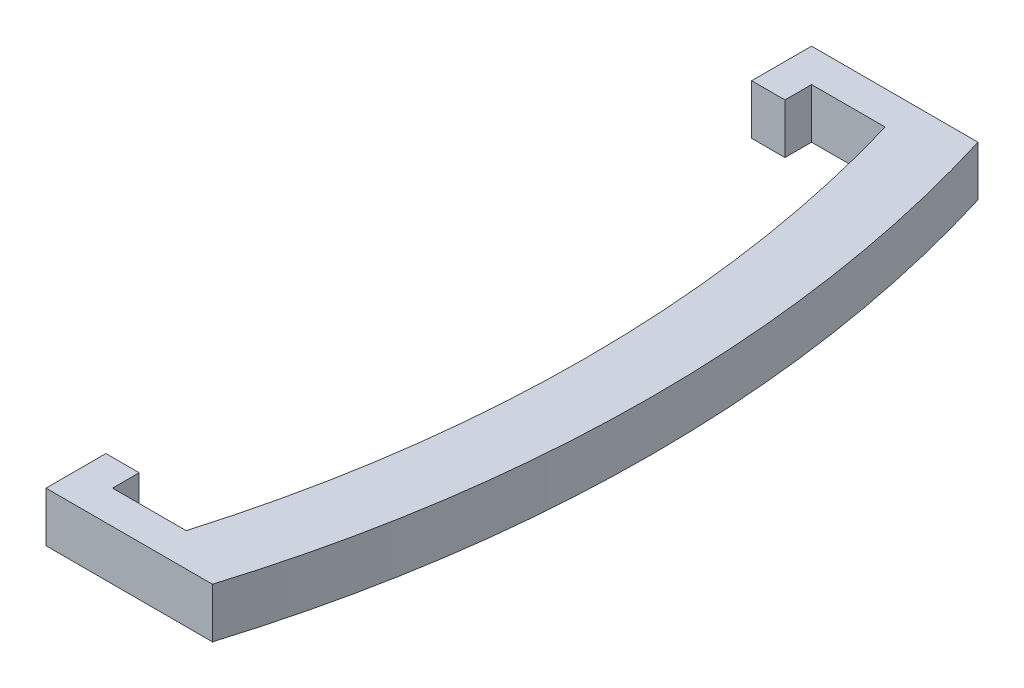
ISO-10303-21;
HEADER;
FILE_DESCRIPTION(('STEP AP214'),'2;1');
FILE_NAME('part.step','',(''),(''),'','','');
FILE_SCHEMA(('AUTOMOTIVE_DESIGN { 1 0 10303 214 1 1 1 1 }'));
ENDSEC;
DATA;
#1=APPLICATION_CONTEXT('core data for automotive mechanical design processes');
#2=APPLICATION_PROTOCOL_DEFINITION('international standard','automotive_design',2000,#1);
#3=PRODUCT_CONTEXT('',#1,'mechanical');
#4=PRODUCT('Part','Part','',(#3));
#5=PRODUCT_RELATED_PRODUCT_CATEGORY('part','',(#4));
#6=PRODUCT_DEFINITION_FORMATION('','',#4);
#7=PRODUCT_DEFINITION_CONTEXT('part definition',#1,'design');
#8=PRODUCT_DEFINITION('design','',#6,#7);
#9=PRODUCT_DEFINITION_SHAPE('','',#8);
#10=(LENGTH_UNIT() NAMED_UNIT(*) SI_UNIT(.MILLI.,.METRE.));
#11=(NAMED_UNIT(*) PLANE_ANGLE_UNIT() SI_UNIT($,.RADIAN.));
#12=(NAMED_UNIT(*) SI_UNIT($,.STERADIAN.) SOLID_ANGLE_UNIT());
#13=UNCERTAINTY_MEASURE_WITH_UNIT(LENGTH_MEASURE(1.E-05),#10,'distance_accuracy_value','');
#14=(GEOMETRIC_REPRESENTATION_CONTEXT(3) GLOBAL_UNCERTAINTY_ASSIGNED_CONTEXT((#13)) GLOBAL_UNIT_ASSIGNED_CONTEXT((#10,
#11,#12)) REPRESENTATION_CONTEXT('',''));
#15=CARTESIAN_POINT('',(0.,0.,0.));
#16=DIRECTION('',(0.,0.,1.));
#17=DIRECTION('',(1.,0.,0.));
#18=AXIS2_PLACEMENT_3D('',#15,#16,#17);
#19=CARTESIAN_POINT('',(47.51,-1.5,-20.4));
#20=DIRECTION('',(0.,1.,0.));
#21=DIRECTION('',(0.,0.,1.));
#22=AXIS2_PLACEMENT_3D('',#19,#20,#21);
#23=CYLINDRICAL_SURFACE('',#22,37.21);
#24=CARTESIAN_POINT('',(47.51,0.,-20.4));
#25=DIRECTION('',(0.,-1.,0.));
#26=DIRECTION('',(0.,0.,1.));
#27=AXIS2_PLACEMENT_3D('',#24,#25,#26);
#28=CIRCLE('',#27,37.21);
#29=CARTESIAN_POINT('',(83.207816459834,0.,-30.9));
#30=VERTEX_POINT('',#29);
#31=CARTESIAN_POINT('',(83.207816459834,0.,-9.9));
#32=VERTEX_POINT('',#31);
#33=EDGE_CURVE('E119',#30,#32,#28,.T.);
#34=ORIENTED_EDGE('',*,*,#33,.F.);
#35=DIRECTION('',(0.,1.,0.));
#36=VECTOR('',#35,1.);
#37=CARTESIAN_POINT('',(83.207816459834,-1.5,-30.9));
#38=LINE('',#37,#36);
#39=CARTESIAN_POINT('',(83.207816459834,-1.5,-30.9));
#40=VERTEX_POINT('',#39);
#41=EDGE_CURVE('E11',#40,#30,#38,.T.);
#42=ORIENTED_EDGE('',*,*,#41,.F.);
#43=CARTESIAN_POINT('',(47.51,-1.5,-20.4));
#44=DIRECTION('',(0.,-1.,0.));
#45=DIRECTION('',(0.,0.,1.));
#46=AXIS2_PLACEMENT_3D('',#43,#44,#45);
#47=CIRCLE('',#46,37.21);
#48=CARTESIAN_POINT('',(83.207816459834,-1.5,-9.9));
#49=VERTEX_POINT('',#48);
#50=EDGE_CURVE('E121',#40,#49,#47,.T.);
#51=ORIENTED_EDGE('',*,*,#50,.T.);
#52=DIRECTION('',(0.,1.,0.));
#53=VECTOR('',#52,1.);
#54=CARTESIAN_POINT('',(83.207816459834,-1.5,-9.9));
#55=LINE('',#54,#53);
#56=EDGE_CURVE('E34',#49,#32,#55,.T.);
#57=ORIENTED_EDGE('',*,*,#56,.T.);
#58=EDGE_LOOP('',(#34,#42,#51,#57));
#59=FACE_BOUND('',#58,.T.);
#60=ADVANCED_FACE('F31',(#59),#23,.F.);
#61=CARTESIAN_POINT('',(80.9956519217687,-1.5,-30.9));
#62=DIRECTION('',(0.,0.,1.));
#63=DIRECTION('',(1.,0.,0.));
#64=AXIS2_PLACEMENT_3D('',#61,#62,#63);
#65=PLANE('',#64);
#66=DIRECTION('',(1.,0.,0.));
#67=VECTOR('',#66,1.);
#68=CARTESIAN_POINT('',(80.9956519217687,0.,-30.9));
#69=LINE('',#68,#67);
#70=CARTESIAN_POINT('',(80.9956519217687,0.,-30.9));
#71=VERTEX_POINT('',#70);
#72=EDGE_CURVE('E137',#71,#30,#69,.T.);
#73=ORIENTED_EDGE('',*,*,#72,.F.);
#74=DIRECTION('',(0.,1.,0.));
#75=VECTOR('',#74,1.);
#76=CARTESIAN_POINT('',(80.9956519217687,-1.5,-30.9));
#77=LINE('',#76,#75);
#78=CARTESIAN_POINT('',(80.9956519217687,-1.5,-30.9));
#79=VERTEX_POINT('',#78);
#80=EDGE_CURVE('E39',#79,#71,#77,.T.);
#81=ORIENTED_EDGE('',*,*,#80,.F.);
#82=DIRECTION('',(1.,0.,0.));
#83=VECTOR('',#82,1.);
#84=CARTESIAN_POINT('',(80.9956519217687,-1.5,-30.9));
#85=LINE('',#84,#83);
#86=EDGE_CURVE('E126',#79,#40,#85,.T.);
#87=ORIENTED_EDGE('',*,*,#86,.T.);
#88=ORIENTED_EDGE('',*,*,#41,.T.);
#89=EDGE_LOOP('',(#73,#81,#87,#88));
#90=FACE_BOUND('',#89,.T.);
#91=ADVANCED_FACE('F244',(#90),#65,.T.);
#92=CARTESIAN_POINT('',(80.9956519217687,-1.5,-30.1));
#93=DIRECTION('',(1.,0.,0.));
#94=DIRECTION('',(0.,0.,-1.));
#95=AXIS2_PLACEMENT_3D('',#92,#93,#94);
#96=PLANE('',#95);
#97=DIRECTION('',(0.,0.,-1.));
#98=VECTOR('',#97,1.);
#99=CARTESIAN_POINT('',(80.9956519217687,0.,-30.1));
#100=LINE('',#99,#98);
#101=CARTESIAN_POINT('',(80.9956519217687,0.,-30.1));
#102=VERTEX_POINT('',#101);
#103=EDGE_CURVE('E162',#102,#71,#100,.T.);
#104=ORIENTED_EDGE('',*,*,#103,.F.);
#105=DIRECTION('',(0.,1.,0.));
#106=VECTOR('',#105,1.);
#107=CARTESIAN_POINT('',(80.9956519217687,-1.5,-30.1));
#108=LINE('',#107,#106);
#109=CARTESIAN_POINT('',(80.9956519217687,-1.5,-30.1));
#110=VERTEX_POINT('',#109);
#111=EDGE_CURVE('E196',#110,#102,#108,.T.);
#112=ORIENTED_EDGE('',*,*,#111,.F.);
#113=DIRECTION('',(0.,0.,-1.));
#114=VECTOR('',#113,1.);
#115=CARTESIAN_POINT('',(80.9956519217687,-1.5,-30.1));
#116=LINE('',#115,#114);
#117=EDGE_CURVE('E192',#110,#79,#116,.T.);
#118=ORIENTED_EDGE('',*,*,#117,.T.);
#119=ORIENTED_EDGE('',*,*,#80,.T.);
#120=EDGE_LOOP('',(#104,#112,#118,#119));
#121=FACE_BOUND('',#120,.T.);
#122=ADVANCED_FACE('F249',(#121),#96,.T.);
#123=CARTESIAN_POINT('',(79.9956519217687,-1.5,-30.1));
#124=DIRECTION('',(0.,0.,1.));
#125=DIRECTION('',(1.,0.,0.));
#126=AXIS2_PLACEMENT_3D('',#123,#124,#125);
#127=PLANE('',#126);
#128=DIRECTION('',(1.,0.,0.));
#129=VECTOR('',#128,1.);
#130=CARTESIAN_POINT('',(79.9956519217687,0.,-30.1));
#131=LINE('',#130,#129);
#132=CARTESIAN_POINT('',(79.9956519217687,0.,-30.1));
#133=VERTEX_POINT('',#132);
#134=EDGE_CURVE('E159',#133,#102,#131,.T.);
#135=ORIENTED_EDGE('',*,*,#134,.F.);
#136=DIRECTION('',(0.,1.,0.));
#137=VECTOR('',#136,1.);
#138=CARTESIAN_POINT('',(79.9956519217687,-1.5,-30.1));
#139=LINE('',#138,#137);
#140=CARTESIAN_POINT('',(79.9956519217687,-1.5,-30.1));
#141=VERTEX_POINT('',#140);
#142=EDGE_CURVE('E198',#141,#133,#139,.T.);
#143=ORIENTED_EDGE('',*,*,#142,.F.);
#144=DIRECTION('',(1.,0.,0.));
#145=VECTOR('',#144,1.);
#146=CARTESIAN_POINT('',(79.9956519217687,-1.5,-30.1));
#147=LINE('',#146,#145);
#148=EDGE_CURVE('E189',#141,#110,#147,.T.);
#149=ORIENTED_EDGE('',*,*,#148,.T.);
#150=ORIENTED_EDGE('',*,*,#111,.T.);
#151=EDGE_LOOP('',(#135,#143,#149,#150));
#152=FACE_BOUND('',#151,.T.);
#153=ADVANCED_FACE('F241',(#152),#127,.T.);
#154=CARTESIAN_POINT('',(79.9956519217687,-1.5,-31.9));
#155=DIRECTION('',(-1.,0.,0.));
#156=DIRECTION('',(0.,0.,1.));
#157=AXIS2_PLACEMENT_3D('',#154,#155,#156);
#158=PLANE('',#157);
#159=DIRECTION('',(0.,0.,1.));
#160=VECTOR('',#159,1.);
#161=CARTESIAN_POINT('',(79.9956519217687,0.,-31.9));
#162=LINE('',#161,#160);
#163=CARTESIAN_POINT('',(79.9956519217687,0.,-31.9));
#164=VERTEX_POINT('',#163);
#165=EDGE_CURVE('E156',#164,#133,#162,.T.);
#166=ORIENTED_EDGE('',*,*,#165,.F.);
#167=DIRECTION('',(0.,1.,0.));
#168=VECTOR('',#167,1.);
#169=CARTESIAN_POINT('',(79.9956519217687,-1.5,-31.9));
#170=LINE('',#169,#168);
#171=CARTESIAN_POINT('',(79.9956519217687,-1.5,-31.9));
#172=VERTEX_POINT('',#171);
#173=EDGE_CURVE('E200',#172,#164,#170,.T.);
#174=ORIENTED_EDGE('',*,*,#173,.F.);
#175=DIRECTION('',(0.,0.,1.));
#176=VECTOR('',#175,1.);
#177=CARTESIAN_POINT('',(79.9956519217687,-1.5,-31.9));
#178=LINE('',#177,#176);
#179=EDGE_CURVE('E186',#172,#141,#178,.T.);
#180=ORIENTED_EDGE('',*,*,#179,.T.);
#181=ORIENTED_EDGE('',*,*,#142,.T.);
#182=EDGE_LOOP('',(#166,#174,#180,#181));
#183=FACE_BOUND('',#182,.T.);
#184=ADVANCED_FACE('F237',(#183),#158,.T.);
#185=CARTESIAN_POINT('',(84.9956519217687,-1.5,-31.9));
#186=DIRECTION('',(0.,0.,-1.));
#187=DIRECTION('',(-1.,0.,0.));
#188=AXIS2_PLACEMENT_3D('',#185,#186,#187);
#189=PLANE('',#188);
#190=DIRECTION('',(-1.,0.,0.));
#191=VECTOR('',#190,1.);
#192=CARTESIAN_POINT('',(84.9956519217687,0.,-31.9));
#193=LINE('',#192,#191);
#194=CARTESIAN_POINT('',(84.9956519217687,0.,-31.9));
#195=VERTEX_POINT('',#194);
#196=EDGE_CURVE('E153',#195,#164,#193,.T.);
#197=ORIENTED_EDGE('',*,*,#196,.F.);
#198=DIRECTION('',(0.,1.,0.));
#199=VECTOR('',#198,1.);
#200=CARTESIAN_POINT('',(84.9956519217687,-1.5,-31.9));
#201=LINE('',#200,#199);
#202=CARTESIAN_POINT('',(84.9956519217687,-1.5,-31.9));
#203=VERTEX_POINT('',#202);
#204=EDGE_CURVE('E202',#203,#195,#201,.T.);
#205=ORIENTED_EDGE('',*,*,#204,.F.);
#206=DIRECTION('',(-1.,0.,0.));
#207=VECTOR('',#206,1.);
#208=CARTESIAN_POINT('',(84.9956519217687,-1.5,-31.9));
#209=LINE('',#208,#207);
#210=EDGE_CURVE('E183',#203,#172,#209,.T.);
#211=ORIENTED_EDGE('',*,*,#210,.T.);
#212=ORIENTED_EDGE('',*,*,#173,.T.);
#213=EDGE_LOOP('',(#197,#205,#211,#212));
#214=FACE_BOUND('',#213,.T.);
#215=ADVANCED_FACE('F233',(#214),#189,.T.);
#216=CARTESIAN_POINT('',(47.51,-1.5,-20.4));
#217=DIRECTION('',(0.,1.,0.));
#218=DIRECTION('',(0.,0.,1.));
#219=AXIS2_PLACEMENT_3D('',#216,#217,#218);
#220=CYLINDRICAL_SURFACE('',#219,39.21);
#221=CARTESIAN_POINT('',(47.51,0.,-20.4));
#222=DIRECTION('',(0.,1.,0.));
#223=DIRECTION('',(0.,0.,-1.));
#224=AXIS2_PLACEMENT_3D('',#221,#222,#223);
#225=CIRCLE('',#224,39.21);
#226=CARTESIAN_POINT('',(84.9956519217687,0.,-8.9));
#227=VERTEX_POINT('',#226);
#228=EDGE_CURVE('E150',#227,#195,#225,.T.);
#229=ORIENTED_EDGE('',*,*,#228,.F.);
#230=DIRECTION('',(0.,1.,0.));
#231=VECTOR('',#230,1.);
#232=CARTESIAN_POINT('',(84.9956519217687,-1.5,-8.9));
#233=LINE('',#232,#231);
#234=CARTESIAN_POINT('',(84.9956519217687,-1.5,-8.9));
#235=VERTEX_POINT('',#234);
#236=EDGE_CURVE('E204',#235,#227,#233,.T.);
#237=ORIENTED_EDGE('',*,*,#236,.F.);
#238=CARTESIAN_POINT('',(47.51,-1.5,-20.4));
#239=DIRECTION('',(0.,1.,0.));
#240=DIRECTION('',(0.,0.,-1.));
#241=AXIS2_PLACEMENT_3D('',#238,#239,#240);
#242=CIRCLE('',#241,39.21);
#243=EDGE_CURVE('E180',#235,#203,#242,.T.);
#244=ORIENTED_EDGE('',*,*,#243,.T.);
#245=ORIENTED_EDGE('',*,*,#204,.T.);
#246=EDGE_LOOP('',(#229,#237,#244,#245));
#247=FACE_BOUND('',#246,.T.);
#248=ADVANCED_FACE('F229',(#247),#220,.T.);
#249=CARTESIAN_POINT('',(84.9956519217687,-1.5,-8.9));
#250=DIRECTION('',(0.,0.,1.));
#251=DIRECTION('',(1.,0.,0.));
#252=AXIS2_PLACEMENT_3D('',#249,#250,#251);
#253=PLANE('',#252);
#254=DIRECTION('',(1.,0.,0.));
#255=VECTOR('',#254,1.);
#256=CARTESIAN_POINT('',(84.9956519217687,0.,-8.9));
#257=LINE('',#256,#255);
#258=CARTESIAN_POINT('',(79.9956519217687,0.,-8.89999999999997));
#259=VERTEX_POINT('',#258);
#260=EDGE_CURVE('E147',#259,#227,#257,.T.);
#261=ORIENTED_EDGE('',*,*,#260,.F.);
#262=DIRECTION('',(0.,1.,0.));
#263=VECTOR('',#262,1.);
#264=CARTESIAN_POINT('',(79.9956519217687,-1.5,-8.89999999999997));
#265=LINE('',#264,#263);
#266=CARTESIAN_POINT('',(79.9956519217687,-1.5,-8.89999999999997));
#267=VERTEX_POINT('',#266);
#268=EDGE_CURVE('E206',#267,#259,#265,.T.);
#269=ORIENTED_EDGE('',*,*,#268,.F.);
#270=DIRECTION('',(1.,0.,0.));
#271=VECTOR('',#270,1.);
#272=CARTESIAN_POINT('',(84.9956519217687,-1.5,-8.9));
#273=LINE('',#272,#271);
#274=EDGE_CURVE('E177',#267,#235,#273,.T.);
#275=ORIENTED_EDGE('',*,*,#274,.T.);
#276=ORIENTED_EDGE('',*,*,#236,.T.);
#277=EDGE_LOOP('',(#261,#269,#275,#276));
#278=FACE_BOUND('',#277,.T.);
#279=ADVANCED_FACE('F225',(#278),#253,.T.);
#280=CARTESIAN_POINT('',(79.9956519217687,-1.5,-8.89999999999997));
#281=DIRECTION('',(-1.,0.,0.));
#282=DIRECTION('',(0.,0.,1.));
#283=AXIS2_PLACEMENT_3D('',#280,#281,#282);
#284=PLANE('',#283);
#285=DIRECTION('',(0.,0.,1.));
#286=VECTOR('',#285,1.);
#287=CARTESIAN_POINT('',(79.9956519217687,0.,-8.89999999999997));
#288=LINE('',#287,#286);
#289=CARTESIAN_POINT('',(79.9956519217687,0.,-10.7));
#290=VERTEX_POINT('',#289);
#291=EDGE_CURVE('E144',#290,#259,#288,.T.);
#292=ORIENTED_EDGE('',*,*,#291,.F.);
#293=DIRECTION('',(0.,1.,0.));
#294=VECTOR('',#293,1.);
#295=CARTESIAN_POINT('',(79.9956519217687,-1.5,-10.7));
#296=LINE('',#295,#294);
#297=CARTESIAN_POINT('',(79.9956519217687,-1.5,-10.7));
#298=VERTEX_POINT('',#297);
#299=EDGE_CURVE('E208',#298,#290,#296,.T.);
#300=ORIENTED_EDGE('',*,*,#299,.F.);
#301=DIRECTION('',(0.,0.,1.));
#302=VECTOR('',#301,1.);
#303=CARTESIAN_POINT('',(79.9956519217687,-1.5,-8.89999999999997));
#304=LINE('',#303,#302);
#305=EDGE_CURVE('E174',#298,#267,#304,.T.);
#306=ORIENTED_EDGE('',*,*,#305,.T.);
#307=ORIENTED_EDGE('',*,*,#268,.T.);
#308=EDGE_LOOP('',(#292,#300,#306,#307));
#309=FACE_BOUND('',#308,.T.);
#310=ADVANCED_FACE('F221',(#309),#284,.T.);
#311=CARTESIAN_POINT('',(79.9956519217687,-1.5,-10.7));
#312=DIRECTION('',(0.,0.,-1.));
#313=DIRECTION('',(-1.,0.,0.));
#314=AXIS2_PLACEMENT_3D('',#311,#312,#313);
#315=PLANE('',#314);
#316=DIRECTION('',(-1.,0.,0.));
#317=VECTOR('',#316,1.);
#318=CARTESIAN_POINT('',(79.9956519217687,0.,-10.7));
#319=LINE('',#318,#317);
#320=CARTESIAN_POINT('',(80.9956519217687,0.,-10.7));
#321=VERTEX_POINT('',#320);
#322=EDGE_CURVE('E141',#321,#290,#319,.T.);
#323=ORIENTED_EDGE('',*,*,#322,.F.);
#324=DIRECTION('',(0.,1.,0.));
#325=VECTOR('',#324,1.);
#326=CARTESIAN_POINT('',(80.9956519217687,-1.5,-10.7));
#327=LINE('',#326,#325);
#328=CARTESIAN_POINT('',(80.9956519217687,-1.5,-10.7));
#329=VERTEX_POINT('',#328);
#330=EDGE_CURVE('E210',#329,#321,#327,.T.);
#331=ORIENTED_EDGE('',*,*,#330,.F.);
#332=DIRECTION('',(-1.,0.,0.));
#333=VECTOR('',#332,1.);
#334=CARTESIAN_POINT('',(79.9956519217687,-1.5,-10.7));
#335=LINE('',#334,#333);
#336=EDGE_CURVE('E171',#329,#298,#335,.T.);
#337=ORIENTED_EDGE('',*,*,#336,.T.);
#338=ORIENTED_EDGE('',*,*,#299,.T.);
#339=EDGE_LOOP('',(#323,#331,#337,#338));
#340=FACE_BOUND('',#339,.T.);
#341=ADVANCED_FACE('F217',(#340),#315,.T.);
#342=CARTESIAN_POINT('',(80.9956519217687,-1.5,-10.7));
#343=DIRECTION('',(1.,0.,0.));
#344=DIRECTION('',(0.,0.,-1.));
#345=AXIS2_PLACEMENT_3D('',#342,#343,#344);
#346=PLANE('',#345);
#347=DIRECTION('',(0.,0.,-1.));
#348=VECTOR('',#347,1.);
#349=CARTESIAN_POINT('',(80.9956519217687,0.,-10.7));
#350=LINE('',#349,#348);
#351=CARTESIAN_POINT('',(80.9956519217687,0.,-9.9));
#352=VERTEX_POINT('',#351);
#353=EDGE_CURVE('E133',#352,#321,#350,.T.);
#354=ORIENTED_EDGE('',*,*,#353,.F.);
#355=DIRECTION('',(0.,1.,0.));
#356=VECTOR('',#355,1.);
#357=CARTESIAN_POINT('',(80.9956519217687,-1.5,-9.9));
#358=LINE('',#357,#356);
#359=CARTESIAN_POINT('',(80.9956519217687,-1.5,-9.9));
#360=VERTEX_POINT('',#359);
#361=EDGE_CURVE('E125',#360,#352,#358,.T.);
#362=ORIENTED_EDGE('',*,*,#361,.F.);
#363=DIRECTION('',(0.,0.,-1.));
#364=VECTOR('',#363,1.);
#365=CARTESIAN_POINT('',(80.9956519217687,-1.5,-10.7));
#366=LINE('',#365,#364);
#367=EDGE_CURVE('E168',#360,#329,#366,.T.);
#368=ORIENTED_EDGE('',*,*,#367,.T.);
#369=ORIENTED_EDGE('',*,*,#330,.T.);
#370=EDGE_LOOP('',(#354,#362,#368,#369));
#371=FACE_BOUND('',#370,.T.);
#372=ADVANCED_FACE('F213',(#371),#346,.T.);
#373=CARTESIAN_POINT('',(80.9956519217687,-1.5,-9.9));
#374=DIRECTION('',(0.,0.,-1.));
#375=DIRECTION('',(-1.,0.,0.));
#376=AXIS2_PLACEMENT_3D('',#373,#374,#375);
#377=PLANE('',#376);
#378=DIRECTION('',(-1.,0.,0.));
#379=VECTOR('',#378,1.);
#380=CARTESIAN_POINT('',(80.9956519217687,0.,-9.9));
#381=LINE('',#380,#379);
#382=EDGE_CURVE('E128',#32,#352,#381,.T.);
#383=ORIENTED_EDGE('',*,*,#382,.F.);
#384=ORIENTED_EDGE('',*,*,#56,.F.);
#385=DIRECTION('',(-1.,0.,0.));
#386=VECTOR('',#385,1.);
#387=CARTESIAN_POINT('',(80.9956519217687,-1.5,-9.9));
#388=LINE('',#387,#386);
#389=EDGE_CURVE('E166',#49,#360,#388,.T.);
#390=ORIENTED_EDGE('',*,*,#389,.T.);
#391=ORIENTED_EDGE('',*,*,#361,.T.);
#392=EDGE_LOOP('',(#383,#384,#390,#391));
#393=FACE_BOUND('',#392,.T.);
#394=ADVANCED_FACE('F129',(#393),#377,.T.);
#395=CARTESIAN_POINT('',(47.51,-1.5,-20.4));
#396=DIRECTION('',(0.,1.,0.));
#397=DIRECTION('',(0.,0.,1.));
#398=AXIS2_PLACEMENT_3D('',#395,#396,#397);
#399=PLANE('',#398);
#400=ORIENTED_EDGE('',*,*,#50,.F.);
#401=ORIENTED_EDGE('',*,*,#86,.F.);
#402=ORIENTED_EDGE('',*,*,#117,.F.);
#403=ORIENTED_EDGE('',*,*,#148,.F.);
#404=ORIENTED_EDGE('',*,*,#179,.F.);
#405=ORIENTED_EDGE('',*,*,#210,.F.);
#406=ORIENTED_EDGE('',*,*,#243,.F.);
#407=ORIENTED_EDGE('',*,*,#274,.F.);
#408=ORIENTED_EDGE('',*,*,#305,.F.);
#409=ORIENTED_EDGE('',*,*,#336,.F.);
#410=ORIENTED_EDGE('',*,*,#367,.F.);
#411=ORIENTED_EDGE('',*,*,#389,.F.);
#412=EDGE_LOOP('',(#400,#401,#402,#403,#404,#405,#406,#407,#408,#409,#410,#411));
#413=FACE_BOUND('',#412,.T.);
#414=ADVANCED_FACE('F248',(#413),#399,.F.);
#415=CARTESIAN_POINT('',(47.51,0.,-20.4));
#416=DIRECTION('',(0.,1.,0.));
#417=DIRECTION('',(0.,0.,1.));
#418=AXIS2_PLACEMENT_3D('',#415,#416,#417);
#419=PLANE('',#418);
#420=ORIENTED_EDGE('',*,*,#33,.T.);
#421=ORIENTED_EDGE('',*,*,#382,.T.);
#422=ORIENTED_EDGE('',*,*,#353,.T.);
#423=ORIENTED_EDGE('',*,*,#322,.T.);
#424=ORIENTED_EDGE('',*,*,#291,.T.);
#425=ORIENTED_EDGE('',*,*,#260,.T.);
#426=ORIENTED_EDGE('',*,*,#228,.T.);
#427=ORIENTED_EDGE('',*,*,#196,.T.);
#428=ORIENTED_EDGE('',*,*,#165,.T.);
#429=ORIENTED_EDGE('',*,*,#134,.T.);
#430=ORIENTED_EDGE('',*,*,#103,.T.);
#431=ORIENTED_EDGE('',*,*,#72,.T.);
#432=EDGE_LOOP('',(#420,#421,#422,#423,#424,#425,#426,#427,#428,#429,#430,#431));
#433=FACE_BOUND('',#432,.T.);
#434=ADVANCED_FACE('F135',(#433),#419,.T.);
#435=CLOSED_SHELL('',(#60,#91,#122,#153,#184,#215,#248,#279,#310,#341,#372,#394,#414,#434));
#436=MANIFOLD_SOLID_BREP('B2',#435);
#437=ADVANCED_BREP_SHAPE_REPRESENTATION('',(#18,#436),#14);
#438=SHAPE_DEFINITION_REPRESENTATION(#9,#437);
ENDSEC;
END-ISO-10303-21;
